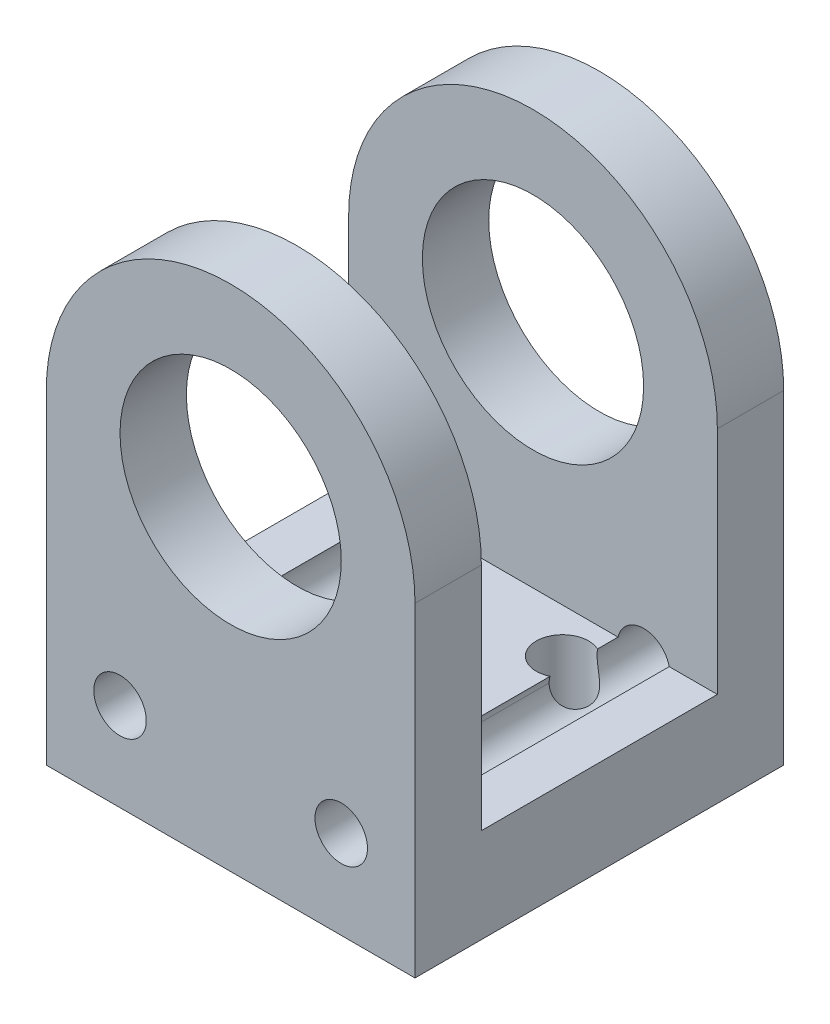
from build123d import *

# Parameters (mm, degrees)
SKETCH1_R             = 4.7625
EXTRUDE1_DEPTH        = 7.9375
SKETCH2_W             = 10.16
SKETCH2_H             = 34.695876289
CUT_EXTRUDE1_DEPTH    = 29.195001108
F_4_40_TAPPED_HOLE2_D = 2.2606
F_4_40_TAPPED_HOLE1_D = 2.2606


with BuildPart() as part:
    # Sketch1 → Extrude1 (new, symmetric)
    with BuildSketch(Plane.XY):
        with BuildLine():
            Line((7.9375, 0), (-7.9375, 0))
            Line((-7.9375, 0), (-7.9375, 13.97))
            ThreePointArc((-7.9375, 13.97), (0, 21.9075), (7.9375, 13.97))
            Line((7.9375, 13.97), (7.9375, 0))
        make_face()
        with Locations((0, 13.97)):
            Circle(SKETCH1_R, mode=Mode.SUBTRACT)
    extrude(amount=EXTRUDE1_DEPTH, both=True)

    # Sketch2 → Cut-Extrude1 (cut, through all)
    with BuildSketch(Plane(origin=(7.9375, 0, 0), x_dir=(0, 0, -1), z_dir=(1, 0, 0))):
        with Locations((0, 21.411938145)):
            Rectangle(SKETCH2_W, SKETCH2_H)
    extrude(amount=-CUT_EXTRUDE1_DEPTH, mode=Mode.SUBTRACT)

    # 4-40 Tapped Hole2 (through all)
    with Locations(Plane.XZ):
        with Locations((-3.175, -3.175), (-3.175, 3.175), (3.175, -3.175), (3.175, 3.175)):
            Hole(F_4_40_TAPPED_HOLE2_D / 2)

    # 4-40 Tapped Hole1 (through all)
    with Locations(Plane(origin=(0, 0, -7.9375), x_dir=(-1, 0, 0), z_dir=(0, 0, -1))):
        with Locations((4.7625, 3.81), (-4.7625, 3.81)):
            Hole(F_4_40_TAPPED_HOLE1_D / 2)


solid = part.part
